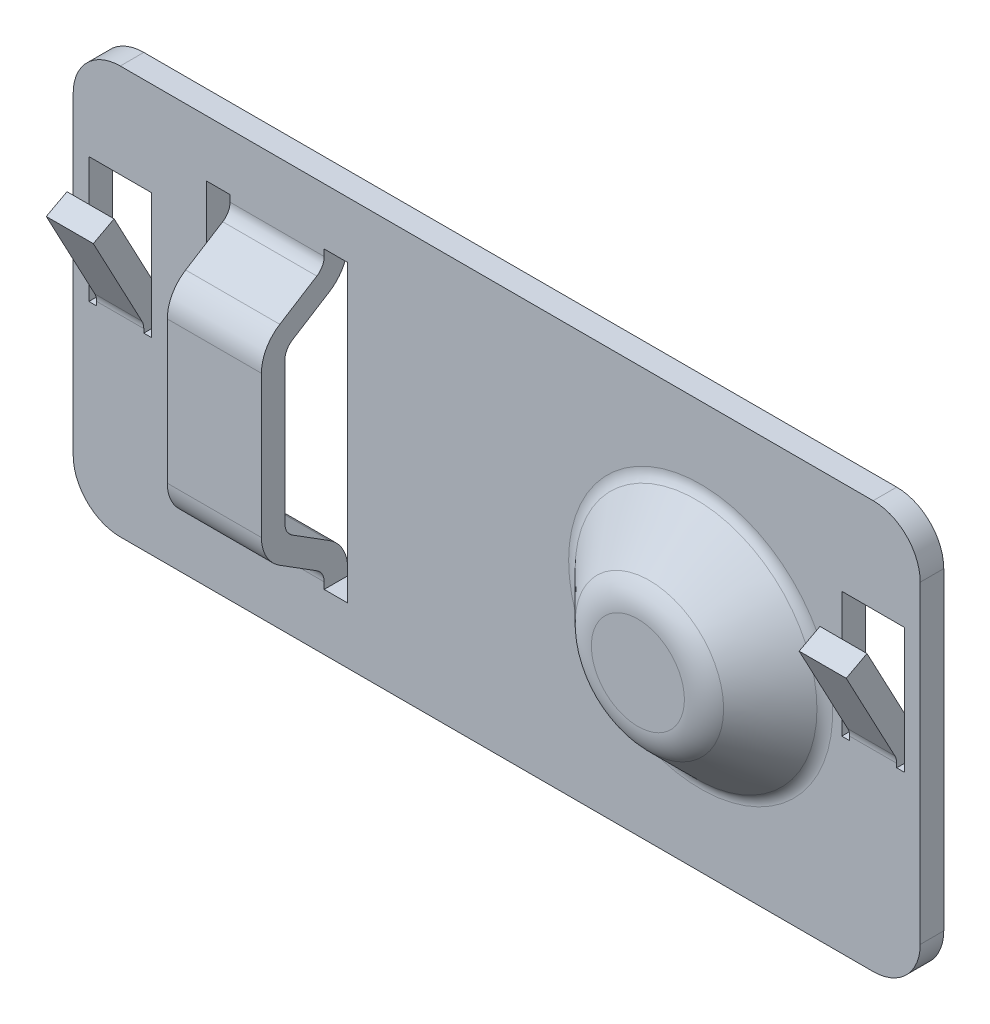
from build123d import *

# Parameters (mm, degrees)
ESQUISSE1_R                      = 3.69
ESQUISSE1_W                      = 2
ESQUISSE1_H                      = 4
ESQUISSE1_W_2                    = 4.5
ESQUISSE1_H_2                    = 9.4
EXTRUSION1_DEPTH                 = 0.75
CONG_1_R                         = 1.25
CONG_2_R                         = 0.5
EXTRUSION2_DEPTH                 = 1.5
CONG_3_R                         = 1.25
CONG_4_R                         = 0.5
EXTRUSION3_DEPTH                 = 0.75
CONG_5_R                         = 0.5
CONG_6_R                         = 1.25
R_P_TITION_LIN_AIRE1_COUNT       = 2
R_P_TITION_LIN_AIRE1_PITCH       = 24
CONG_5_OF_R_P_TITION_LIN_AIRE1_R = 0.5
CONG_6_OF_R_P_TITION_LIN_AIRE1_R = 1.25


with BuildPart() as part:
    # Esquisse1 → Extrusion1 (new body)
    with BuildSketch(Plane.XY):
        with BuildLine():
            Line((-18.5, -6.5), (5.5, -6.5))
            ThreePointArc((5.5, -6.5), (6.560660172, -6.060660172), (7, -5))
            Line((7, -5), (7, 5))
            ThreePointArc((7, 5), (6.560660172, 6.060660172), (5.5, 6.5))
            Line((5.5, 6.5), (-18.5, 6.5))
            ThreePointArc((-18.5, 6.5), (-19.560660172, 6.060660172), (-20, 5))
            Line((-20, 5), (-20, -5))
            ThreePointArc((-20, -5), (-19.560660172, -6.060660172), (-18.5, -6.5))
        make_face()
        Circle(ESQUISSE1_R, mode=Mode.SUBTRACT)
        with Locations((-18.5, 1.5)):
            Rectangle(ESQUISSE1_W, ESQUISSE1_H, mode=Mode.SUBTRACT)
        with Locations((-13.5, 0)):
            Rectangle(ESQUISSE1_W_2, ESQUISSE1_H_2, mode=Mode.SUBTRACT)
        with Locations((5.5, 1.5)):
            Rectangle(ESQUISSE1_W, ESQUISSE1_H, mode=Mode.SUBTRACT)
    extrude(amount=EXTRUSION1_DEPTH)

    # Esquisse2 → R_volution1 (revolve)
    with BuildSketch(Plane(origin=(0, 0, 0), x_dir=(0, 0, -1), z_dir=(1, 0, 0)), mode=Mode.PRIVATE) as r_volution1_sk:
        Polygon((0, 3.69), (-2, 1.69), (-2, 0), (-2.75, 0), (-2.75, 2.000660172), (-0.75, 4.000660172), align=None)
    revolve(r_volution1_sk.sketch.rotate(Axis((0, 0, -1.988688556), (0, 0, 1)), 90), axis=Axis((0, 0, -1.988688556), (0, 0, 1)))

    # Cong_1
    cong_1_edges = [part.edges().sort_by_distance(p)[0] for p in [
        (3.69, 0, 0),
        (2.000660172, 0, 2.75),
    ]]
    fillet(cong_1_edges, radius=CONG_1_R)

    # Cong_2
    cong_2_edges = [part.edges().sort_by_distance(p)[0] for p in [
        (4.000660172, 0, 0.75),
        (1.69, 0, 2),
    ]]
    fillet(cong_2_edges, radius=CONG_2_R)

    # Esquisse3 → Extrusion2 (add, symmetric)
    with BuildSketch(Plane(origin=(-13.5, 0, 0), x_dir=(0, 0, -1), z_dir=(1, 0, 0))):
        Polygon((-0.75, -4.214620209), (-2.75, -2.958562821), (-2.75, 2.958562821), (-0.75, 4.214620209), (-0.75, 4.756578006), (0, 4.756578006), (0, 3.8), (-2, 2.543942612), (-2, -2.543942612), (0, -3.8), (0, -4.7), (-0.75, -4.7), align=None)
    extrude(amount=EXTRUSION2_DEPTH, both=True)

    # Cong_3
    cong_3_edges = [part.edges().sort_by_distance(p)[0] for p in [
        (-13.5, 2.958562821, 2.75),
        (-13.5, -2.958562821, 2.75),
        (-13.5, -3.8, 0),
        (-13.5, 3.8, 0),
    ]]
    fillet(cong_3_edges, radius=CONG_3_R)

    # Cong_4
    cong_4_edges = [part.edges().sort_by_distance(p)[0] for p in [
        (-13.5, 4.214620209, 0.75),
        (-13.5, -4.214620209, 0.75),
        (-13.5, -2.543942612, 2),
        (-13.5, 2.543942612, 2),
    ]]
    fillet(cong_4_edges, radius=CONG_4_R)

    # Esquisse4 → Extrusion3 (add, symmetric)
    with BuildSketch(Plane(origin=(5.5, 0, 0), x_dir=(0, 0, -1), z_dir=(1, 0, 0))):
        Polygon((0, -0.063003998), (-1.696731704, 3.128084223), (-2.358942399, 2.775980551), (-0.75, -0.25), (-0.75, -0.5), (0, -0.5), align=None)
    extrusion3 = extrude(amount=EXTRUSION3_DEPTH, both=True)

    # Cong_5
    cong_5_edges = [part.edges().sort_by_distance(p)[0] for p in [
        (5.5, -0.25, 0.75),
    ]]
    fillet(cong_5_edges, radius=CONG_5_R)

    # Cong_6
    cong_6_edges = [part.edges().sort_by_distance(p)[0] for p in [
        (5.5, -0.063003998, 0),
    ]]
    fillet(cong_6_edges, radius=CONG_6_R)

    # R_p_tition lin_aire1: Extrusion3 ×2
    with Locations(*[(-i * R_P_TITION_LIN_AIRE1_PITCH, 0, 0) for i in range(1, R_P_TITION_LIN_AIRE1_COUNT)]):
        add(extrusion3)

    # Cong_5 of R_p_tition lin_aire1
    cong_5_of_r_p_tition_lin_aire1_edges = [part.edges().sort_by_distance(p)[0] for p in [
        (-18.5, -0.25, 0.75),
    ]]
    fillet(cong_5_of_r_p_tition_lin_aire1_edges, radius=CONG_5_OF_R_P_TITION_LIN_AIRE1_R)

    # Cong_6 of R_p_tition lin_aire1
    cong_6_of_r_p_tition_lin_aire1_edges = [part.edges().sort_by_distance(p)[0] for p in [
        (-18.5, -0.063003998, 0),
    ]]
    fillet(cong_6_of_r_p_tition_lin_aire1_edges, radius=CONG_6_OF_R_P_TITION_LIN_AIRE1_R)


solid = part.part
